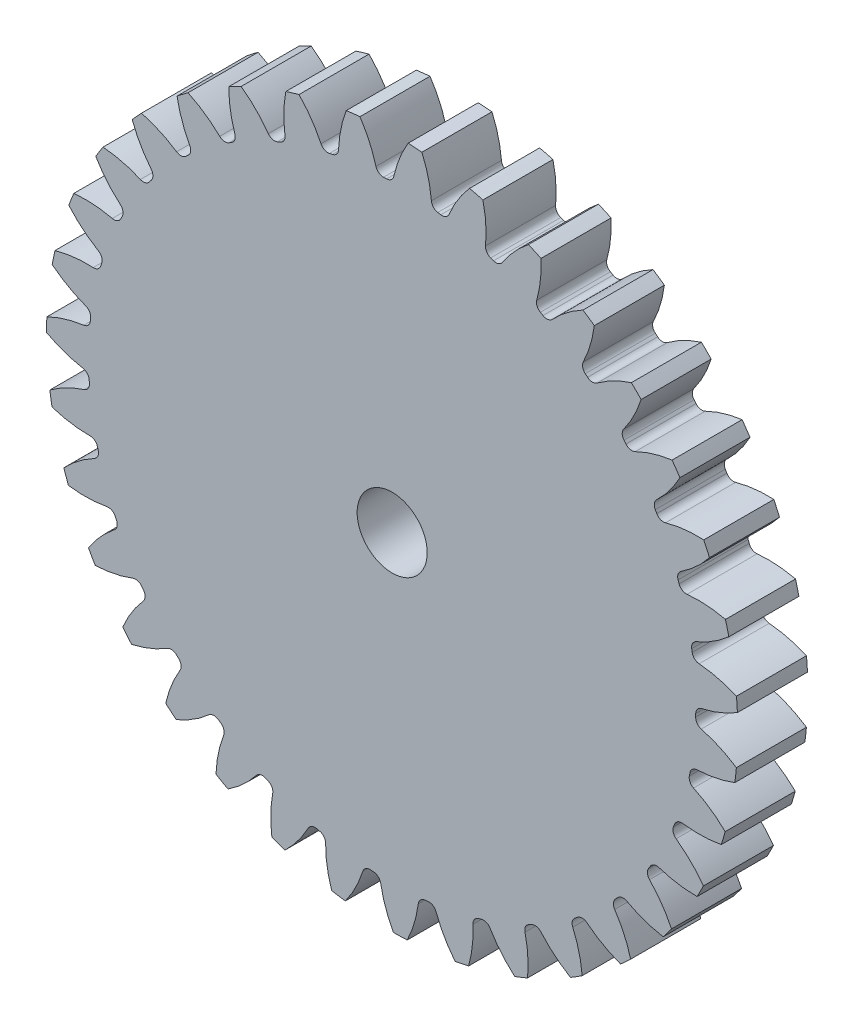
from build123d import *

# Parameters (mm, degrees)
SKETCH3_R         = 626.533333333
GEARBODY_DEPTH    = 127
TOOTHCUT_DEPTH    = 896.107276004
CIRPATTERN1_COUNT = 35
BOREDIA_R         = 63.5
BORE_DEPTH        = 12700


with BuildPart() as part:
    # Sketch3 → gearBody (new body)
    with BuildSketch(Plane.XY):
        Circle(SKETCH3_R)
    extrude(amount=GEARBODY_DEPTH)

    # Sketch2 → toothCut (cut, through all)
    with BuildSketch(Plane.XY):
        with BuildLine():
            ThreePointArc((550.14231453, -14.498673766), (550.208421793, -11.724775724), (550.260542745, -8.950579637))
            ThreePointArc((550.260542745, -8.950579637), (553.358983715, -0.465291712), (561.045928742, 4.279318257))
            ThreePointArc((561.045928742, 4.279318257), (594.89275518, 14.826811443), (626.533333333, 30.818405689))
            ThreePointArc((626.533333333, 30.818405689), (627.148456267, -13.364344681), (624.651704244, -57.480781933))
            ThreePointArc((624.651704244, -57.480781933), (593.721091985, -40.155814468), (560.354315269, -28.176019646))
            ThreePointArc((560.354315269, -28.176019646), (552.876469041, -23.108252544), (550.14231453, -14.498673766))
        make_face()
    toothcut = extrude(amount=TOOTHCUT_DEPTH, mode=Mode.SUBTRACT)

    # CirPattern1: toothCut ×35 about axis
    cirpattern1_axis = Axis((0, 0, 0), (0, 0, 1))
    for i in range(1, CIRPATTERN1_COUNT):
        add(toothcut.rotate(cirpattern1_axis, i * 360 / CIRPATTERN1_COUNT), mode=Mode.SUBTRACT)

    # boreDia → bore (cut, symmetric)
    with BuildSketch(Plane.XY):
        Circle(BOREDIA_R)
    extrude(amount=BORE_DEPTH, both=True, mode=Mode.SUBTRACT)


solid = part.part
